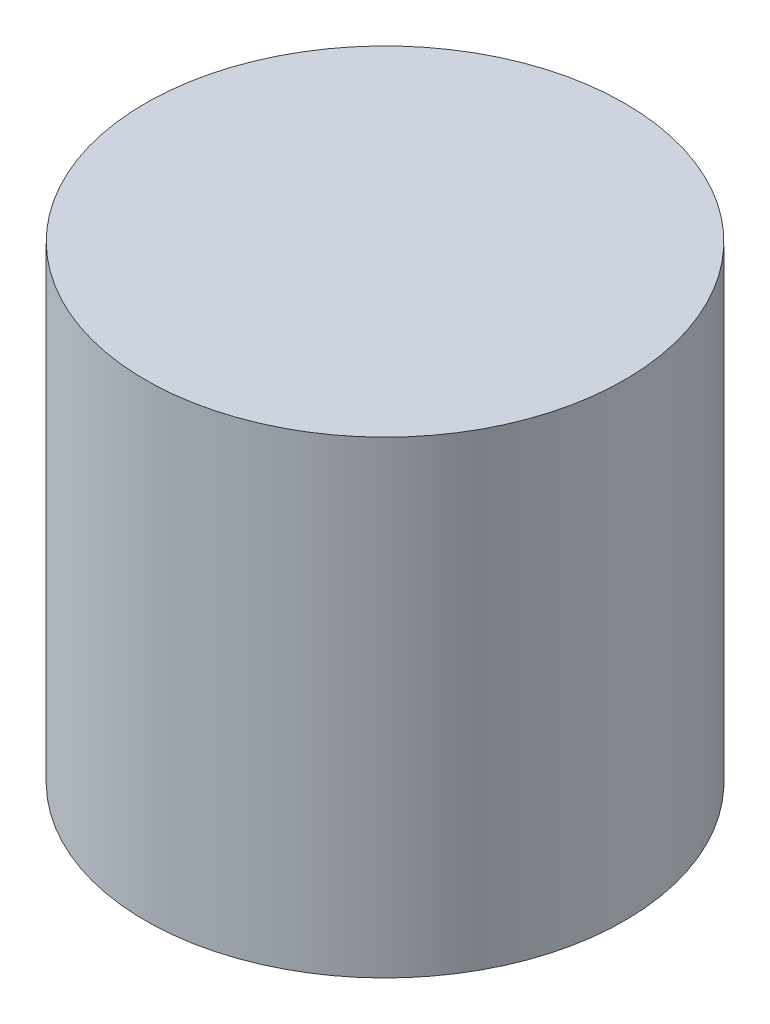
ISO-10303-21;
HEADER;
FILE_DESCRIPTION(('STEP AP214'),'2;1');
FILE_NAME('part.step','',(''),(''),'','','');
FILE_SCHEMA(('AUTOMOTIVE_DESIGN { 1 0 10303 214 1 1 1 1 }'));
ENDSEC;
DATA;
#1=APPLICATION_CONTEXT('core data for automotive mechanical design processes');
#2=APPLICATION_PROTOCOL_DEFINITION('international standard','automotive_design',2000,#1);
#3=PRODUCT_CONTEXT('',#1,'mechanical');
#4=PRODUCT('Part','Part','',(#3));
#5=PRODUCT_RELATED_PRODUCT_CATEGORY('part','',(#4));
#6=PRODUCT_DEFINITION_FORMATION('','',#4);
#7=PRODUCT_DEFINITION_CONTEXT('part definition',#1,'design');
#8=PRODUCT_DEFINITION('design','',#6,#7);
#9=PRODUCT_DEFINITION_SHAPE('','',#8);
#10=(LENGTH_UNIT() NAMED_UNIT(*) SI_UNIT(.MILLI.,.METRE.));
#11=(NAMED_UNIT(*) PLANE_ANGLE_UNIT() SI_UNIT($,.RADIAN.));
#12=(NAMED_UNIT(*) SI_UNIT($,.STERADIAN.) SOLID_ANGLE_UNIT());
#13=UNCERTAINTY_MEASURE_WITH_UNIT(LENGTH_MEASURE(1.E-05),#10,'distance_accuracy_value','');
#14=(GEOMETRIC_REPRESENTATION_CONTEXT(3) GLOBAL_UNCERTAINTY_ASSIGNED_CONTEXT((#13)) GLOBAL_UNIT_ASSIGNED_CONTEXT((#10,
#11,#12)) REPRESENTATION_CONTEXT('',''));
#15=CARTESIAN_POINT('',(0.,0.,0.));
#16=DIRECTION('',(0.,0.,1.));
#17=DIRECTION('',(1.,0.,0.));
#18=AXIS2_PLACEMENT_3D('',#15,#16,#17);
#19=CARTESIAN_POINT('',(0.,76.2,0.));
#20=DIRECTION('',(0.,-1.,0.));
#21=DIRECTION('',(0.,0.,-1.));
#22=AXIS2_PLACEMENT_3D('',#19,#20,#21);
#23=CYLINDRICAL_SURFACE('',#22,38.9821017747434);
#24=CARTESIAN_POINT('',(0.,76.2,0.));
#25=DIRECTION('',(0.,1.,0.));
#26=DIRECTION('',(0.,0.,1.));
#27=AXIS2_PLACEMENT_3D('',#24,#25,#26);
#28=CIRCLE('',#27,38.9821017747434);
#29=CARTESIAN_POINT('',(0.,76.2,-38.9821017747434));
#30=VERTEX_POINT('',#29);
#31=EDGE_CURVE('E10',#30,#30,#28,.T.);
#32=CARTESIAN_POINT('',(0.,0.,0.));
#33=DIRECTION('',(0.,1.,0.));
#34=DIRECTION('',(0.,0.,1.));
#35=AXIS2_PLACEMENT_3D('',#32,#33,#34);
#36=CIRCLE('',#35,38.9821017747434);
#37=CARTESIAN_POINT('',(0.,0.,-38.9821017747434));
#38=VERTEX_POINT('',#37);
#39=EDGE_CURVE('E34',#38,#38,#36,.T.);
#40=CARTESIAN_POINT('',(0.,76.2,-38.9821017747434));
#41=CARTESIAN_POINT('',(0.,75.40625,-38.9821017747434));
#42=CARTESIAN_POINT('',(0.,74.6125,-38.9821017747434));
#43=CARTESIAN_POINT('',(0.,73.025,-38.9821017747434));
#44=CARTESIAN_POINT('',(0.,72.23125,-38.9821017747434));
#45=CARTESIAN_POINT('',(0.,70.64375,-38.9821017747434));
#46=CARTESIAN_POINT('',(0.,69.85,-38.9821017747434));
#47=CARTESIAN_POINT('',(0.,68.2625,-38.9821017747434));
#48=CARTESIAN_POINT('',(0.,67.46875,-38.9821017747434));
#49=CARTESIAN_POINT('',(0.,65.88125,-38.9821017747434));
#50=CARTESIAN_POINT('',(0.,65.0875,-38.9821017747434));
#51=CARTESIAN_POINT('',(0.,63.5,-38.9821017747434));
#52=CARTESIAN_POINT('',(0.,62.70625,-38.9821017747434));
#53=CARTESIAN_POINT('',(0.,61.11875,-38.9821017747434));
#54=CARTESIAN_POINT('',(0.,60.325,-38.9821017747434));
#55=CARTESIAN_POINT('',(0.,58.7375,-38.9821017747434));
#56=CARTESIAN_POINT('',(0.,57.94375,-38.9821017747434));
#57=CARTESIAN_POINT('',(0.,56.35625,-38.9821017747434));
#58=CARTESIAN_POINT('',(0.,55.5625,-38.9821017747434));
#59=CARTESIAN_POINT('',(0.,53.975,-38.9821017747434));
#60=CARTESIAN_POINT('',(0.,53.18125,-38.9821017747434));
#61=CARTESIAN_POINT('',(0.,51.59375,-38.9821017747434));
#62=CARTESIAN_POINT('',(0.,50.8,-38.9821017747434));
#63=CARTESIAN_POINT('',(0.,49.2125,-38.9821017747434));
#64=CARTESIAN_POINT('',(0.,48.41875,-38.9821017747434));
#65=CARTESIAN_POINT('',(0.,46.83125,-38.9821017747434));
#66=CARTESIAN_POINT('',(0.,46.0375,-38.9821017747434));
#67=CARTESIAN_POINT('',(0.,44.45,-38.9821017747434));
#68=CARTESIAN_POINT('',(0.,43.65625,-38.9821017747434));
#69=CARTESIAN_POINT('',(0.,42.06875,-38.9821017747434));
#70=CARTESIAN_POINT('',(0.,41.275,-38.9821017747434));
#71=CARTESIAN_POINT('',(0.,39.6875,-38.9821017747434));
#72=CARTESIAN_POINT('',(0.,38.89375,-38.9821017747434));
#73=CARTESIAN_POINT('',(0.,37.30625,-38.9821017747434));
#74=CARTESIAN_POINT('',(0.,36.5125,-38.9821017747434));
#75=CARTESIAN_POINT('',(0.,34.925,-38.9821017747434));
#76=CARTESIAN_POINT('',(0.,34.13125,-38.9821017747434));
#77=CARTESIAN_POINT('',(0.,32.54375,-38.9821017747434));
#78=CARTESIAN_POINT('',(0.,31.75,-38.9821017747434));
#79=CARTESIAN_POINT('',(0.,30.1625,-38.9821017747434));
#80=CARTESIAN_POINT('',(0.,29.36875,-38.9821017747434));
#81=CARTESIAN_POINT('',(0.,27.78125,-38.9821017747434));
#82=CARTESIAN_POINT('',(0.,26.9875,-38.9821017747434));
#83=CARTESIAN_POINT('',(0.,25.4,-38.9821017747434));
#84=CARTESIAN_POINT('',(0.,24.60625,-38.9821017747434));
#85=CARTESIAN_POINT('',(0.,23.01875,-38.9821017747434));
#86=CARTESIAN_POINT('',(0.,22.225,-38.9821017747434));
#87=CARTESIAN_POINT('',(0.,20.6375,-38.9821017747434));
#88=CARTESIAN_POINT('',(0.,19.84375,-38.9821017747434));
#89=CARTESIAN_POINT('',(0.,18.25625,-38.9821017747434));
#90=CARTESIAN_POINT('',(0.,17.4625,-38.9821017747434));
#91=CARTESIAN_POINT('',(0.,15.875,-38.9821017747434));
#92=CARTESIAN_POINT('',(0.,15.08125,-38.9821017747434));
#93=CARTESIAN_POINT('',(0.,13.49375,-38.9821017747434));
#94=CARTESIAN_POINT('',(0.,12.7,-38.9821017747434));
#95=CARTESIAN_POINT('',(0.,11.1125,-38.9821017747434));
#96=CARTESIAN_POINT('',(0.,10.31875,-38.9821017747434));
#97=CARTESIAN_POINT('',(0.,8.73125,-38.9821017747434));
#98=CARTESIAN_POINT('',(0.,7.93750000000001,-38.9821017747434));
#99=CARTESIAN_POINT('',(0.,6.35,-38.9821017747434));
#100=CARTESIAN_POINT('',(0.,5.55625,-38.9821017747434));
#101=CARTESIAN_POINT('',(0.,3.96875,-38.9821017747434));
#102=CARTESIAN_POINT('',(0.,3.175,-38.9821017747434));
#103=CARTESIAN_POINT('',(0.,1.5875,-38.9821017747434));
#104=CARTESIAN_POINT('',(0.,0.793750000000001,-38.9821017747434));
#105=CARTESIAN_POINT('',(0.,0.,-38.9821017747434));
#106=B_SPLINE_CURVE_WITH_KNOTS('',3,(#40,#41,#42,#43,#44,#45,#46,#47,#48,#49,#50,#51,#52,#53,
#54,#55,#56,#57,#58,#59,#60,#61,#62,#63,#64,#65,#66,#67,#68,#69,#70,#71,#72,#73,#74,#75,#76,#77,
#78,#79,#80,#81,#82,#83,#84,#85,#86,#87,#88,#89,#90,#91,#92,#93,#94,#95,#96,#97,#98,#99,#100,
#101,#102,#103,#104,#105),.UNSPECIFIED.,.F.,.F.,(4,2,2,2,2,2,2,2,2,2,2,2,2,2,2,2,2,2,2,2,2,2,2,
2,2,2,2,2,2,2,2,2,4),(0.,2.38124999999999,4.76249999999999,7.14374999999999,9.52499999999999,
11.90625,14.2875,16.66875,19.05,21.43125,23.8125,26.19375,28.575,30.95625,33.3375,35.71875,38.1,
40.48125,42.8625,45.24375,47.625,50.00625,52.3875,54.76875,57.15,59.53125,61.9125,64.29375,
66.675,69.05625,71.4375,73.81875,76.2),.UNSPECIFIED.);
#107=EDGE_CURVE('BSEAM31',#30,#38,#106,.T.);
#108=ORIENTED_EDGE('',*,*,#31,.F.);
#109=ORIENTED_EDGE('',*,*,#39,.T.);
#110=ORIENTED_EDGE('',*,*,#107,.T.);
#111=ORIENTED_EDGE('',*,*,#107,.F.);
#112=EDGE_LOOP('',(#108,#110,#109,#111));
#113=FACE_BOUND('',#112,.T.);
#114=ADVANCED_FACE('F31',(#113),#23,.T.);
#115=CARTESIAN_POINT('',(0.,76.2,0.));
#116=DIRECTION('',(0.,1.,0.));
#117=DIRECTION('',(0.,0.,1.));
#118=AXIS2_PLACEMENT_3D('',#115,#116,#117);
#119=PLANE('',#118);
#120=ORIENTED_EDGE('',*,*,#31,.T.);
#121=EDGE_LOOP('',(#120));
#122=FACE_BOUND('',#121,.T.);
#123=ADVANCED_FACE('F46',(#122),#119,.T.);
#124=CARTESIAN_POINT('',(0.,0.,0.));
#125=DIRECTION('',(0.,1.,0.));
#126=DIRECTION('',(0.,0.,1.));
#127=AXIS2_PLACEMENT_3D('',#124,#125,#126);
#128=PLANE('',#127);
#129=ORIENTED_EDGE('',*,*,#39,.F.);
#130=EDGE_LOOP('',(#129));
#131=FACE_BOUND('',#130,.T.);
#132=ADVANCED_FACE('F44',(#131),#128,.F.);
#133=CLOSED_SHELL('',(#114,#123,#132));
#134=MANIFOLD_SOLID_BREP('B2',#133);
#135=ADVANCED_BREP_SHAPE_REPRESENTATION('',(#18,#134),#14);
#136=SHAPE_DEFINITION_REPRESENTATION(#9,#135);
ENDSEC;
END-ISO-10303-21;
